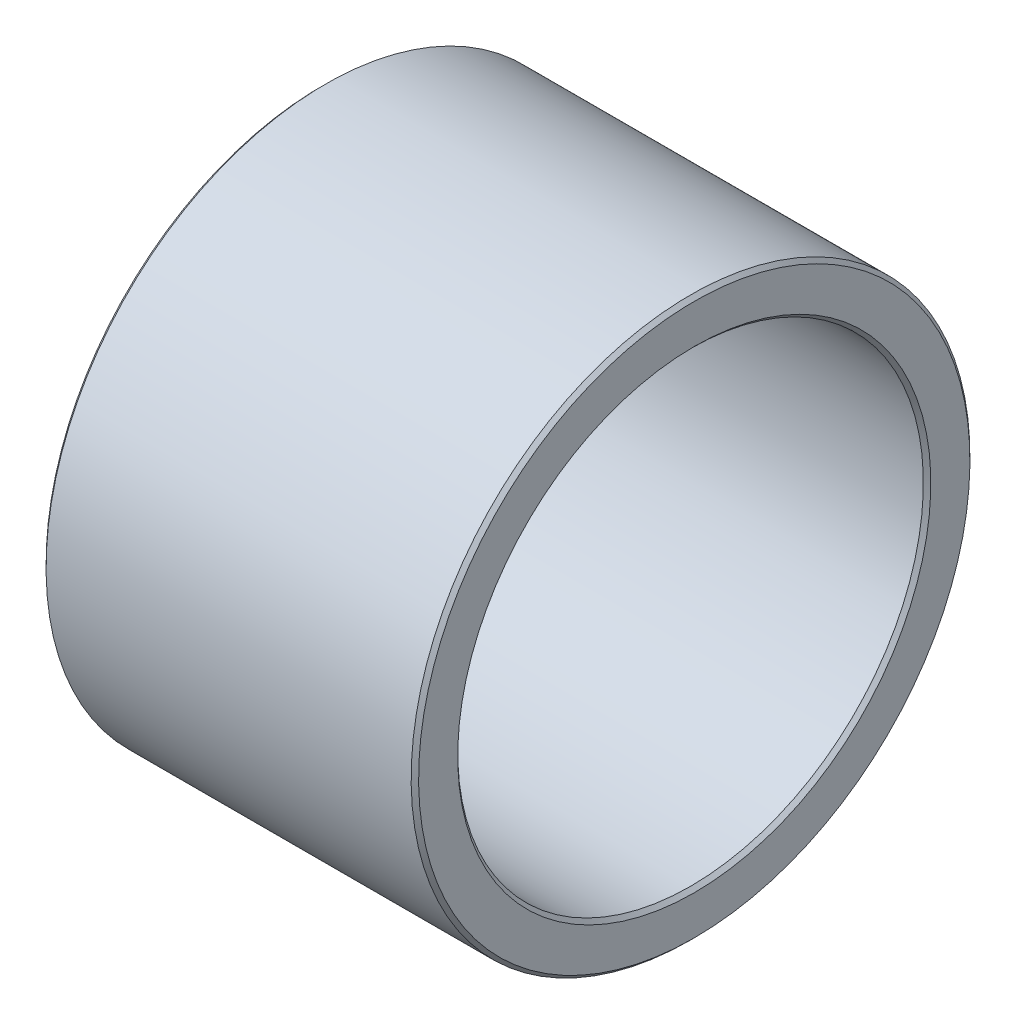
ISO-10303-21;
HEADER;
FILE_DESCRIPTION(('STEP AP214'),'2;1');
FILE_NAME('part.step','',(''),(''),'','','');
FILE_SCHEMA(('AUTOMOTIVE_DESIGN { 1 0 10303 214 1 1 1 1 }'));
ENDSEC;
DATA;
#1=APPLICATION_CONTEXT('core data for automotive mechanical design processes');
#2=APPLICATION_PROTOCOL_DEFINITION('international standard','automotive_design',2000,#1);
#3=PRODUCT_CONTEXT('',#1,'mechanical');
#4=PRODUCT('Part','Part','',(#3));
#5=PRODUCT_RELATED_PRODUCT_CATEGORY('part','',(#4));
#6=PRODUCT_DEFINITION_FORMATION('','',#4);
#7=PRODUCT_DEFINITION_CONTEXT('part definition',#1,'design');
#8=PRODUCT_DEFINITION('design','',#6,#7);
#9=PRODUCT_DEFINITION_SHAPE('','',#8);
#10=(LENGTH_UNIT() NAMED_UNIT(*) SI_UNIT(.MILLI.,.METRE.));
#11=(NAMED_UNIT(*) PLANE_ANGLE_UNIT() SI_UNIT($,.RADIAN.));
#12=(NAMED_UNIT(*) SI_UNIT($,.STERADIAN.) SOLID_ANGLE_UNIT());
#13=UNCERTAINTY_MEASURE_WITH_UNIT(LENGTH_MEASURE(1.E-05),#10,'distance_accuracy_value','');
#14=(GEOMETRIC_REPRESENTATION_CONTEXT(3) GLOBAL_UNCERTAINTY_ASSIGNED_CONTEXT((#13)) GLOBAL_UNIT_ASSIGNED_CONTEXT((#10,
#11,#12)) REPRESENTATION_CONTEXT('',''));
#15=CARTESIAN_POINT('',(0.,0.,0.));
#16=DIRECTION('',(0.,0.,1.));
#17=DIRECTION('',(1.,0.,0.));
#18=AXIS2_PLACEMENT_3D('',#15,#16,#17);
#19=CARTESIAN_POINT('',(0.,-27.5,0.));
#20=DIRECTION('',(-1.,0.,0.));
#21=DIRECTION('',(0.,1.,0.));
#22=AXIS2_PLACEMENT_3D('',#19,#20,#21);
#23=PLANE('',#22);
#24=CARTESIAN_POINT('',(0.,0.,0.));
#25=DIRECTION('',(1.,0.,0.));
#26=DIRECTION('',(0.,-1.,0.));
#27=AXIS2_PLACEMENT_3D('',#24,#25,#26);
#28=CIRCLE('',#27,25.4);
#29=CARTESIAN_POINT('',(0.,-25.4,0.));
#30=VERTEX_POINT('',#29);
#31=EDGE_CURVE('E9',#30,#30,#28,.T.);
#32=ORIENTED_EDGE('',*,*,#31,.T.);
#33=EDGE_LOOP('',(#32));
#34=FACE_BOUND('',#33,.T.);
#35=CARTESIAN_POINT('',(0.,0.,0.));
#36=DIRECTION('',(1.,0.,0.));
#37=DIRECTION('',(0.,-1.,0.));
#38=AXIS2_PLACEMENT_3D('',#35,#36,#37);
#39=CIRCLE('',#38,29.6);
#40=CARTESIAN_POINT('',(0.,-29.6,0.));
#41=VERTEX_POINT('',#40);
#42=EDGE_CURVE('E53',#41,#41,#39,.T.);
#43=ORIENTED_EDGE('',*,*,#42,.F.);
#44=EDGE_LOOP('',(#43));
#45=FACE_BOUND('',#44,.T.);
#46=ADVANCED_FACE('F15',(#34,#45),#23,.T.);
#47=CARTESIAN_POINT('',(0.2,0.,0.));
#48=DIRECTION('',(-1.,0.,0.));
#49=DIRECTION('',(0.,-1.,0.));
#50=AXIS2_PLACEMENT_3D('',#47,#48,#49);
#51=CONICAL_SURFACE('',#50,25.2,0.78539816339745);
#52=CARTESIAN_POINT('',(0.4,0.,0.));
#53=DIRECTION('',(1.,0.,0.));
#54=DIRECTION('',(0.,-1.,0.));
#55=AXIS2_PLACEMENT_3D('',#52,#53,#54);
#56=CIRCLE('',#55,25.);
#57=CARTESIAN_POINT('',(0.4,-25.,0.));
#58=VERTEX_POINT('',#57);
#59=EDGE_CURVE('E22',#58,#58,#56,.T.);
#60=ORIENTED_EDGE('',*,*,#59,.T.);
#61=EDGE_LOOP('',(#60));
#62=FACE_BOUND('',#61,.T.);
#63=ORIENTED_EDGE('',*,*,#31,.F.);
#64=EDGE_LOOP('',(#63));
#65=FACE_BOUND('',#64,.T.);
#66=ADVANCED_FACE('F82',(#62,#65),#51,.F.);
#67=CARTESIAN_POINT('',(20.,0.,0.));
#68=DIRECTION('',(-1.,0.,0.));
#69=DIRECTION('',(0.,-1.,0.));
#70=AXIS2_PLACEMENT_3D('',#67,#68,#69);
#71=CYLINDRICAL_SURFACE('',#70,25.);
#72=CARTESIAN_POINT('',(39.6,0.,0.));
#73=DIRECTION('',(1.,0.,0.));
#74=DIRECTION('',(0.,-1.,0.));
#75=AXIS2_PLACEMENT_3D('',#72,#73,#74);
#76=CIRCLE('',#75,25.);
#77=CARTESIAN_POINT('',(39.6,-25.,0.));
#78=VERTEX_POINT('',#77);
#79=EDGE_CURVE('E58',#78,#78,#76,.T.);
#80=ORIENTED_EDGE('',*,*,#79,.T.);
#81=EDGE_LOOP('',(#80));
#82=FACE_BOUND('',#81,.T.);
#83=ORIENTED_EDGE('',*,*,#59,.F.);
#84=EDGE_LOOP('',(#83));
#85=FACE_BOUND('',#84,.T.);
#86=ADVANCED_FACE('F66',(#82,#85),#71,.F.);
#87=CARTESIAN_POINT('',(39.8,0.,0.));
#88=DIRECTION('',(1.,0.,0.));
#89=DIRECTION('',(0.,-1.,0.));
#90=AXIS2_PLACEMENT_3D('',#87,#88,#89);
#91=CONICAL_SURFACE('',#90,25.2,0.785398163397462);
#92=CARTESIAN_POINT('',(40.,0.,0.));
#93=DIRECTION('',(1.,0.,0.));
#94=DIRECTION('',(0.,-1.,0.));
#95=AXIS2_PLACEMENT_3D('',#92,#93,#94);
#96=CIRCLE('',#95,25.4);
#97=CARTESIAN_POINT('',(40.,-25.4,0.));
#98=VERTEX_POINT('',#97);
#99=EDGE_CURVE('E63',#98,#98,#96,.T.);
#100=ORIENTED_EDGE('',*,*,#99,.T.);
#101=EDGE_LOOP('',(#100));
#102=FACE_BOUND('',#101,.T.);
#103=ORIENTED_EDGE('',*,*,#79,.F.);
#104=EDGE_LOOP('',(#103));
#105=FACE_BOUND('',#104,.T.);
#106=ADVANCED_FACE('F69',(#102,#105),#91,.F.);
#107=CARTESIAN_POINT('',(40.,-27.5,0.));
#108=DIRECTION('',(1.,0.,0.));
#109=DIRECTION('',(0.,-1.,0.));
#110=AXIS2_PLACEMENT_3D('',#107,#108,#109);
#111=PLANE('',#110);
#112=CARTESIAN_POINT('',(40.,0.,0.));
#113=DIRECTION('',(1.,0.,0.));
#114=DIRECTION('',(0.,-1.,0.));
#115=AXIS2_PLACEMENT_3D('',#112,#113,#114);
#116=CIRCLE('',#115,29.6);
#117=CARTESIAN_POINT('',(40.,-29.6,0.));
#118=VERTEX_POINT('',#117);
#119=EDGE_CURVE('E61',#118,#118,#116,.T.);
#120=ORIENTED_EDGE('',*,*,#119,.T.);
#121=EDGE_LOOP('',(#120));
#122=FACE_BOUND('',#121,.T.);
#123=ORIENTED_EDGE('',*,*,#99,.F.);
#124=EDGE_LOOP('',(#123));
#125=FACE_BOUND('',#124,.T.);
#126=ADVANCED_FACE('F71',(#122,#125),#111,.T.);
#127=CARTESIAN_POINT('',(39.8,0.,0.));
#128=DIRECTION('',(-1.,0.,0.));
#129=DIRECTION('',(0.,-1.,0.));
#130=AXIS2_PLACEMENT_3D('',#127,#128,#129);
#131=CONICAL_SURFACE('',#130,29.8,0.785398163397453);
#132=CARTESIAN_POINT('',(39.6,0.,0.));
#133=DIRECTION('',(1.,0.,0.));
#134=DIRECTION('',(0.,-1.,0.));
#135=AXIS2_PLACEMENT_3D('',#132,#133,#134);
#136=CIRCLE('',#135,30.);
#137=CARTESIAN_POINT('',(39.6,-30.,0.));
#138=VERTEX_POINT('',#137);
#139=EDGE_CURVE('E55',#138,#138,#136,.T.);
#140=ORIENTED_EDGE('',*,*,#139,.T.);
#141=EDGE_LOOP('',(#140));
#142=FACE_BOUND('',#141,.T.);
#143=ORIENTED_EDGE('',*,*,#119,.F.);
#144=EDGE_LOOP('',(#143));
#145=FACE_BOUND('',#144,.T.);
#146=ADVANCED_FACE('F79',(#142,#145),#131,.T.);
#147=CARTESIAN_POINT('',(20.,0.,0.));
#148=DIRECTION('',(-1.,0.,0.));
#149=DIRECTION('',(0.,-1.,0.));
#150=AXIS2_PLACEMENT_3D('',#147,#148,#149);
#151=CYLINDRICAL_SURFACE('',#150,30.);
#152=CARTESIAN_POINT('',(0.4,0.,0.));
#153=DIRECTION('',(1.,0.,0.));
#154=DIRECTION('',(0.,-1.,0.));
#155=AXIS2_PLACEMENT_3D('',#152,#153,#154);
#156=CIRCLE('',#155,30.);
#157=CARTESIAN_POINT('',(0.4,-30.,0.));
#158=VERTEX_POINT('',#157);
#159=EDGE_CURVE('E49',#158,#158,#156,.T.);
#160=ORIENTED_EDGE('',*,*,#159,.T.);
#161=EDGE_LOOP('',(#160));
#162=FACE_BOUND('',#161,.T.);
#163=ORIENTED_EDGE('',*,*,#139,.F.);
#164=EDGE_LOOP('',(#163));
#165=FACE_BOUND('',#164,.T.);
#166=ADVANCED_FACE('F50',(#162,#165),#151,.T.);
#167=CARTESIAN_POINT('',(0.2,0.,0.));
#168=DIRECTION('',(1.,0.,0.));
#169=DIRECTION('',(0.,-1.,0.));
#170=AXIS2_PLACEMENT_3D('',#167,#168,#169);
#171=CONICAL_SURFACE('',#170,29.8,0.785398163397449);
#172=ORIENTED_EDGE('',*,*,#42,.T.);
#173=EDGE_LOOP('',(#172));
#174=FACE_BOUND('',#173,.T.);
#175=ORIENTED_EDGE('',*,*,#159,.F.);
#176=EDGE_LOOP('',(#175));
#177=FACE_BOUND('',#176,.T.);
#178=ADVANCED_FACE('F92',(#174,#177),#171,.T.);
#179=CLOSED_SHELL('',(#46,#66,#86,#106,#126,#146,#166,#178));
#180=MANIFOLD_SOLID_BREP('B1',#179);
#181=ADVANCED_BREP_SHAPE_REPRESENTATION('',(#18,#180),#14);
#182=SHAPE_DEFINITION_REPRESENTATION(#9,#181);
ENDSEC;
END-ISO-10303-21;
